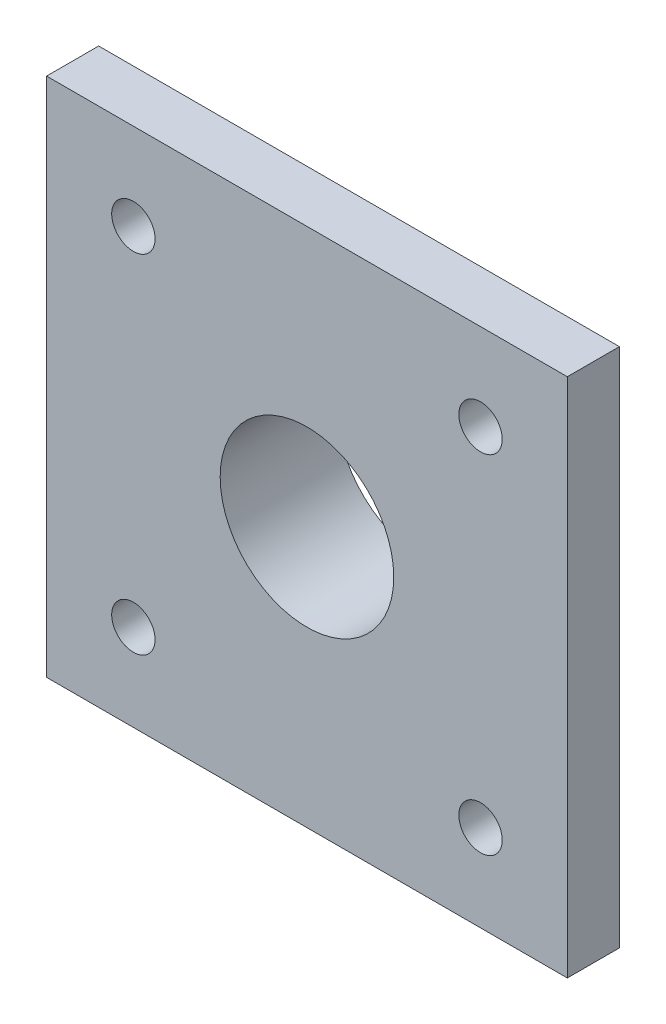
from build123d import *

# Parameters (mm, degrees)
SKETCH_1_W          = 120
SKETCH_1_H          = 120
EXTRUDE_1_DEPTH     = 12
SKETCH_2_R          = 35
EXTRUDE_2_DEPTH     = 27
SKETCH_3_R          = 20
CUT_EXTRUDE_1_DEPTH = 27
SKETCH_4_R          = 5
CUT_EXTRUDE_2_DEPTH = 12
SKETCH_5_R          = 5
CUT_EXTRUDE_3_DEPTH = 12
SKETCH_6_R          = 5
CUT_EXTRUDE_4_DEPTH = 12
SKETCH_7_R          = 5
CUT_EXTRUDE_5_DEPTH = 12


with BuildPart() as part:
    # Sketch 1 → Extrude 1 (new body)
    with BuildSketch(Plane.XY):
        Rectangle(SKETCH_1_W, SKETCH_1_H)
    extrude(amount=-EXTRUDE_1_DEPTH)

    # Sketch 2 → Extrude 2 (add)
    with BuildSketch(Plane.XY):
        Circle(SKETCH_2_R)
    extrude(amount=-EXTRUDE_2_DEPTH)

    # Sketch 3 → Cut-Extrude 1 (cut)
    with BuildSketch(Plane.XY):
        Circle(SKETCH_3_R)
    extrude(amount=-CUT_EXTRUDE_1_DEPTH, mode=Mode.SUBTRACT)

    # Sketch 4 → Cut-Extrude 2 (cut)
    with BuildSketch(Plane.XY):
        with Locations((40, 40)):
            Circle(SKETCH_4_R)
    extrude(amount=-CUT_EXTRUDE_2_DEPTH, mode=Mode.SUBTRACT)

    # Sketch 5 → Cut-Extrude 3 (cut)
    with BuildSketch(Plane.XY):
        with Locations((-40, 40)):
            Circle(SKETCH_5_R)
    extrude(amount=-CUT_EXTRUDE_3_DEPTH, mode=Mode.SUBTRACT)

    # Sketch 6 → Cut-Extrude 4 (cut)
    with BuildSketch(Plane.XY):
        with Locations((-40, -40)):
            Circle(SKETCH_6_R)
    extrude(amount=-CUT_EXTRUDE_4_DEPTH, mode=Mode.SUBTRACT)

    # Sketch 7 → Cut-Extrude 5 (cut)
    with BuildSketch(Plane.XY):
        with Locations((40, -40)):
            Circle(SKETCH_7_R)
    extrude(amount=-CUT_EXTRUDE_5_DEPTH, mode=Mode.SUBTRACT)


solid = part.part
